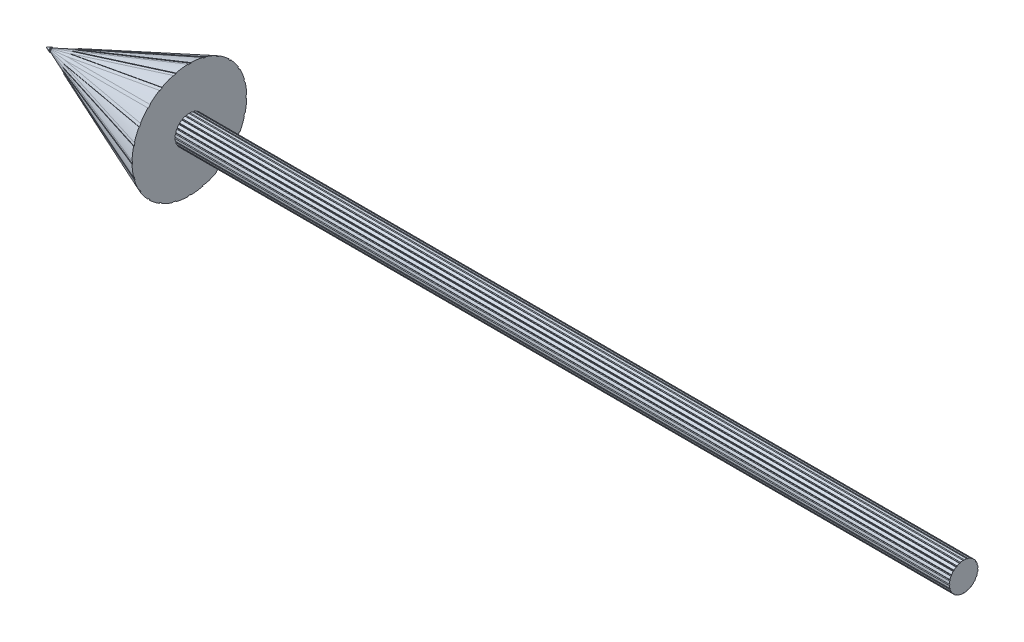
from build123d import *

# Parameters (mm, degrees)
ESQUISSE1_R                  = 0.5
BOSS_EXTRU_1_DEPTH           = 27
ENL_V_MAT_EXTRU_1_DEPTH      = 27
R_P_TITION_CIRCULAIRE1_COUNT = 24
ENL_V_MAT_EXTRU_2_DEPTH      = 0.05
R_P_TITION_CIRCULAIRE2_COUNT = 24


with BuildPart() as part:
    # Esquisse1 → Boss.-Extru.1 (new body)
    with BuildSketch(Plane(origin=(0, 0, 0), x_dir=(0, 0, -1), z_dir=(1, 0, 0))):
        Circle(ESQUISSE1_R)
    extrude(amount=BOSS_EXTRU_1_DEPTH)

    # Esquisse2 → R_volution1 (revolve)
    with BuildSketch(Plane.XY, mode=Mode.PRIVATE) as r_volution1_sk:
        Polygon((0, 0), (0, 2), (-5, 0), align=None)
    revolve(r_volution1_sk.sketch.rotate(Axis((0, 0, 0), (-1, 0, 0)), 90), axis=Axis((0, 0, 0), (-1, 0, 0)))

    # Esquisse3 → Enl_v. mat.-Extru.1 (cut)
    with BuildSketch(Plane(origin=(27, 0, 0), x_dir=(0, 0, -1), z_dir=(1, 0, 0))):
        Polygon((0, 0.48), (-0.05, 0.53), (0.05, 0.53), align=None)
    enl_v_mat_extru_1 = extrude(amount=-ENL_V_MAT_EXTRU_1_DEPTH, mode=Mode.SUBTRACT)

    # R_p_tition circulaire1: Enl_v. mat.-Extru.1 ×24 about axis
    r_p_tition_circulaire1_axis = Axis((0, 0, 0), (1, 0, 0))
    for i in range(1, R_P_TITION_CIRCULAIRE1_COUNT):
        add(enl_v_mat_extru_1.rotate(r_p_tition_circulaire1_axis, i * 360 / R_P_TITION_CIRCULAIRE1_COUNT), mode=Mode.SUBTRACT)

    # Esquisse4 → Enl_v. mat.-Extru.2 (cut, symmetric)
    with BuildSketch(Plane.XY):
        Polygon((0, 1.978459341), (-4.772110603, 0.0696151), (-4.825962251, 0.0696151), (0, 2), align=None)
    enl_v_mat_extru_2 = extrude(amount=ENL_V_MAT_EXTRU_2_DEPTH, both=True, mode=Mode.SUBTRACT)

    # R_p_tition circulaire2: Enl_v. mat.-Extru.2 ×24 about axis
    r_p_tition_circulaire2_axis = Axis((0, 0, 0), (1, 0, 0))
    for i in range(1, R_P_TITION_CIRCULAIRE2_COUNT):
        add(enl_v_mat_extru_2.rotate(r_p_tition_circulaire2_axis, i * 360 / R_P_TITION_CIRCULAIRE2_COUNT), mode=Mode.SUBTRACT)


solid = part.part
